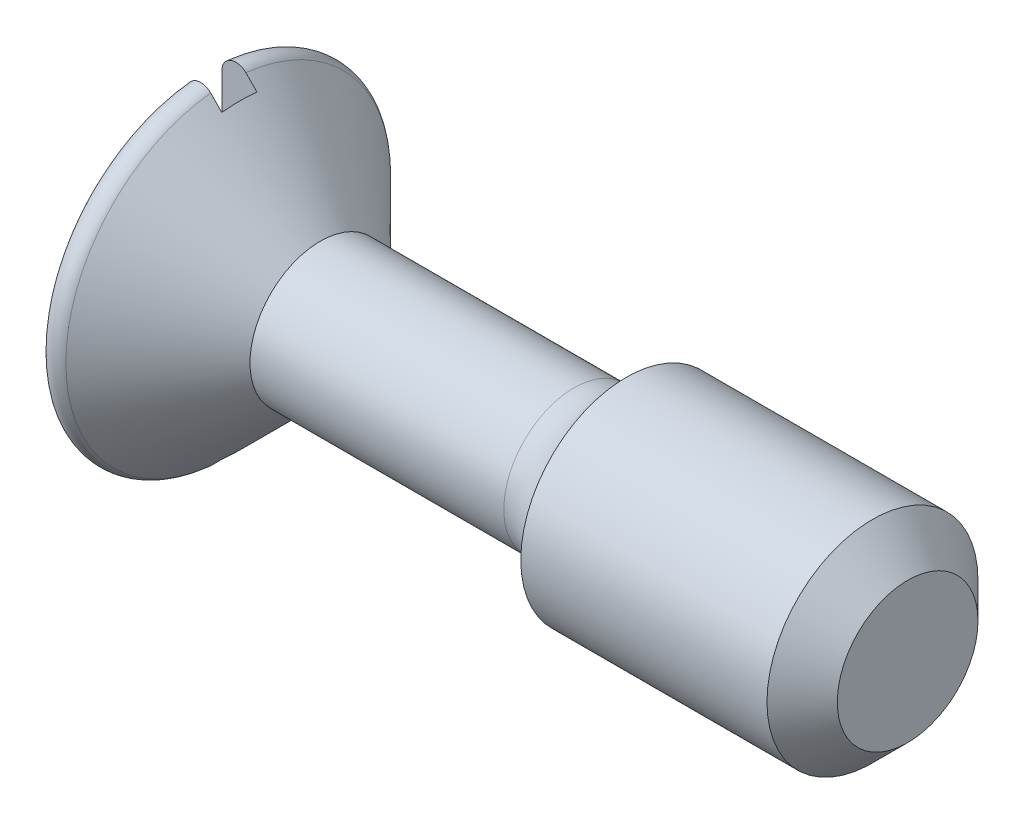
ISO-10303-21;
HEADER;
FILE_DESCRIPTION(('STEP AP214'),'2;1');
FILE_NAME('part.step','',(''),(''),'','','');
FILE_SCHEMA(('AUTOMOTIVE_DESIGN { 1 0 10303 214 1 1 1 1 }'));
ENDSEC;
DATA;
#1=APPLICATION_CONTEXT('core data for automotive mechanical design processes');
#2=APPLICATION_PROTOCOL_DEFINITION('international standard','automotive_design',2000,#1);
#3=PRODUCT_CONTEXT('',#1,'mechanical');
#4=PRODUCT('Part','Part','',(#3));
#5=PRODUCT_RELATED_PRODUCT_CATEGORY('part','',(#4));
#6=PRODUCT_DEFINITION_FORMATION('','',#4);
#7=PRODUCT_DEFINITION_CONTEXT('part definition',#1,'design');
#8=PRODUCT_DEFINITION('design','',#6,#7);
#9=PRODUCT_DEFINITION_SHAPE('','',#8);
#10=(LENGTH_UNIT() NAMED_UNIT(*) SI_UNIT(.MILLI.,.METRE.));
#11=(NAMED_UNIT(*) PLANE_ANGLE_UNIT() SI_UNIT($,.RADIAN.));
#12=(NAMED_UNIT(*) SI_UNIT($,.STERADIAN.) SOLID_ANGLE_UNIT());
#13=UNCERTAINTY_MEASURE_WITH_UNIT(LENGTH_MEASURE(1.E-05),#10,'distance_accuracy_value','');
#14=(GEOMETRIC_REPRESENTATION_CONTEXT(3) GLOBAL_UNCERTAINTY_ASSIGNED_CONTEXT((#13)) GLOBAL_UNIT_ASSIGNED_CONTEXT((#10,
#11,#12)) REPRESENTATION_CONTEXT('',''));
#15=CARTESIAN_POINT('',(0.,0.,0.));
#16=DIRECTION('',(0.,0.,1.));
#17=DIRECTION('',(1.,0.,0.));
#18=AXIS2_PLACEMENT_3D('',#15,#16,#17);
#19=CARTESIAN_POINT('',(10.,0.,0.));
#20=DIRECTION('',(-1.,0.,0.));
#21=DIRECTION('',(0.,0.,1.));
#22=AXIS2_PLACEMENT_3D('',#19,#20,#21);
#23=CYLINDRICAL_SURFACE('',#22,1.);
#24=CARTESIAN_POINT('',(5.25838015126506,0.,0.));
#25=DIRECTION('',(1.,0.,0.));
#26=DIRECTION('',(0.,0.,-1.));
#27=AXIS2_PLACEMENT_3D('',#24,#25,#26);
#28=CIRCLE('',#27,1.);
#29=CARTESIAN_POINT('',(5.25838015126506,0.,-1.));
#30=VERTEX_POINT('',#29);
#31=EDGE_CURVE('E127',#30,#30,#28,.F.);
#32=ORIENTED_EDGE('',*,*,#31,.T.);
#33=EDGE_LOOP('',(#32));
#34=FACE_BOUND('',#33,.T.);
#35=CARTESIAN_POINT('',(1.65,0.,0.));
#36=DIRECTION('',(1.,0.,0.));
#37=DIRECTION('',(0.,0.,-1.));
#38=AXIS2_PLACEMENT_3D('',#35,#36,#37);
#39=CIRCLE('',#38,1.);
#40=CARTESIAN_POINT('',(1.65,0.,-1.));
#41=VERTEX_POINT('',#40);
#42=EDGE_CURVE('E175',#41,#41,#39,.T.);
#43=ORIENTED_EDGE('',*,*,#42,.T.);
#44=EDGE_LOOP('',(#43));
#45=FACE_BOUND('',#44,.T.);
#46=ADVANCED_FACE('F37',(#34,#45),#23,.T.);
#47=CARTESIAN_POINT('',(0.,0.,0.));
#48=DIRECTION('',(1.,0.,0.));
#49=DIRECTION('',(0.,0.,-1.));
#50=AXIS2_PLACEMENT_3D('',#47,#48,#49);
#51=PLANE('',#50);
#52=DIRECTION('',(0.,-1.,0.));
#53=VECTOR('',#52,1.);
#54=CARTESIAN_POINT('',(0.,0.,0.25));
#55=LINE('',#54,#53);
#56=CARTESIAN_POINT('',(0.,2.15268918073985,0.25));
#57=VERTEX_POINT('',#56);
#58=CARTESIAN_POINT('',(0.,-2.15268918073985,0.25));
#59=VERTEX_POINT('',#58);
#60=EDGE_CURVE('E121',#57,#59,#55,.T.);
#61=ORIENTED_EDGE('',*,*,#60,.T.);
#62=CARTESIAN_POINT('',(0.,0.,0.));
#63=DIRECTION('',(1.,0.,0.));
#64=DIRECTION('',(0.,0.,-1.));
#65=AXIS2_PLACEMENT_3D('',#62,#63,#64);
#66=CIRCLE('',#65,2.16715728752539);
#67=EDGE_CURVE('E212',#59,#57,#66,.F.);
#68=ORIENTED_EDGE('',*,*,#67,.T.);
#69=EDGE_LOOP('',(#61,#68));
#70=FACE_BOUND('',#69,.T.);
#71=ADVANCED_FACE('F180',(#70),#51,.F.);
#72=CARTESIAN_POINT('',(1.65,0.,0.));
#73=DIRECTION('',(-1.,0.,0.));
#74=DIRECTION('',(0.,0.,-1.));
#75=AXIS2_PLACEMENT_3D('',#72,#73,#74);
#76=CONICAL_SURFACE('',#75,1.,0.78539816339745);
#77=CARTESIAN_POINT('',(-3.19431959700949,5.83897007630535,0.250000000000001));
#78=CARTESIAN_POINT('',(-2.9925484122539,5.63701255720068,0.250000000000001));
#79=CARTESIAN_POINT('',(-2.79078541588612,5.43504685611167,0.250000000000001));
#80=CARTESIAN_POINT('',(-2.38728568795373,5.03108777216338,0.250000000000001));
#81=CARTESIAN_POINT('',(-2.18554895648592,4.82909438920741,0.250000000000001));
#82=CARTESIAN_POINT('',(-1.78209774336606,4.42505469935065,0.250000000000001));
#83=CARTESIAN_POINT('',(-1.5803832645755,4.22300838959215,0.250000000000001));
#84=CARTESIAN_POINT('',(-1.17701269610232,3.81885891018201,0.25));
#85=CARTESIAN_POINT('',(-0.975356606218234,3.61675574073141,0.25));
#86=CARTESIAN_POINT('',(-0.572415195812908,3.21273755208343,0.25));
#87=CARTESIAN_POINT('',(-0.371129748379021,3.01082265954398,0.25));
#88=CARTESIAN_POINT('',(0.0312756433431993,2.60682402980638,0.25));
#89=CARTESIAN_POINT('',(0.232395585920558,2.40474029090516,0.25));
#90=CARTESIAN_POINT('',(0.634311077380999,2.00026706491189,0.25));
#91=CARTESIAN_POINT('',(0.835106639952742,1.79787759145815,0.25));
#92=CARTESIAN_POINT('',(1.13564700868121,1.49365156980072,0.25));
#93=CARTESIAN_POINT('',(1.2357174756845,1.39213677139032,0.249999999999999));
#94=CARTESIAN_POINT('',(1.43545086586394,1.18870725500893,0.249999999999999));
#95=CARTESIAN_POINT('',(1.5351137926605,1.08679254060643,0.249999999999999));
#96=CARTESIAN_POINT('',(1.6614682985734,0.956420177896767,0.249999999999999));
#97=CARTESIAN_POINT('',(1.68858376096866,0.928373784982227,0.249999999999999));
#98=CARTESIAN_POINT('',(1.74271923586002,0.872189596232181,0.249999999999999));
#99=CARTESIAN_POINT('',(1.7697392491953,0.844051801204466,0.249999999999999));
#100=CARTESIAN_POINT('',(1.85064043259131,0.759444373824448,0.249999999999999));
#101=CARTESIAN_POINT('',(1.90434197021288,0.702802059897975,0.249999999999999));
#102=CARTESIAN_POINT('',(1.99321764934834,0.607497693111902,0.249999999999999));
#103=CARTESIAN_POINT('',(2.02865077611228,0.569078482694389,0.249999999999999));
#104=CARTESIAN_POINT('',(2.08122108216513,0.510956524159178,0.249999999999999));
#105=CARTESIAN_POINT('',(2.09864022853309,0.491509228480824,0.249999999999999));
#106=CARTESIAN_POINT('',(2.13322258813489,0.452374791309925,0.249999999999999));
#107=CARTESIAN_POINT('',(2.15038570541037,0.432687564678,0.249999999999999));
#108=CARTESIAN_POINT('',(2.19098847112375,0.385224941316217,0.249999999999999));
#109=CARTESIAN_POINT('',(2.21425447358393,0.357300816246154,0.249999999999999));
#110=CARTESIAN_POINT('',(2.25952453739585,0.300453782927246,0.249999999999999));
#111=CARTESIAN_POINT('',(2.28152963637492,0.271531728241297,0.249999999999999));
#112=CARTESIAN_POINT('',(2.31841483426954,0.218468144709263,0.249999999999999));
#113=CARTESIAN_POINT('',(2.33379613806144,0.194678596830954,0.249999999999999));
#114=CARTESIAN_POINT('',(2.36152808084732,0.145369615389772,0.249999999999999));
#115=CARTESIAN_POINT('',(2.37389137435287,0.119857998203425,0.249999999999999));
#116=CARTESIAN_POINT('',(2.38836926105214,0.0783628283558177,0.249999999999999));
#117=CARTESIAN_POINT('',(2.3925984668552,0.0631513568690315,0.249999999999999));
#118=CARTESIAN_POINT('',(2.39838048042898,0.0322553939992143,0.249999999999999));
#119=CARTESIAN_POINT('',(2.39994347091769,0.0165729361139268,0.249999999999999));
#120=CARTESIAN_POINT('',(2.40005362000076,-0.014866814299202,0.249999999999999));
#121=CARTESIAN_POINT('',(2.39858853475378,-0.0306241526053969,0.249999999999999));
#122=CARTESIAN_POINT('',(2.39296444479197,-0.0616709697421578,0.249999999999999));
#123=CARTESIAN_POINT('',(2.38879654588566,-0.0769587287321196,0.249999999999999));
#124=CARTESIAN_POINT('',(2.37808786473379,-0.108010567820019,0.249999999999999));
#125=CARTESIAN_POINT('',(2.37138508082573,-0.123716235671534,0.249999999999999));
#126=CARTESIAN_POINT('',(2.35646848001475,-0.154405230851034,0.249999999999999));
#127=CARTESIAN_POINT('',(2.34825171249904,-0.169387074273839,0.249999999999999));
#128=CARTESIAN_POINT('',(2.33076684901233,-0.198876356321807,0.249999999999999));
#129=CARTESIAN_POINT('',(2.32149084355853,-0.213379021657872,0.249999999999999));
#130=CARTESIAN_POINT('',(2.30227623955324,-0.241913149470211,0.249999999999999));
#131=CARTESIAN_POINT('',(2.29233826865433,-0.255945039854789,0.249999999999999));
#132=CARTESIAN_POINT('',(2.25986484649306,-0.300232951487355,0.249999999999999));
#133=CARTESIAN_POINT('',(2.23646143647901,-0.329847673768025,0.249999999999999));
#134=CARTESIAN_POINT('',(2.18856631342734,-0.388188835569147,0.249999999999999));
#135=CARTESIAN_POINT('',(2.16407394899,-0.4169147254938,0.249999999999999));
#136=CARTESIAN_POINT('',(2.11441429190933,-0.473863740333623,0.249999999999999));
#137=CARTESIAN_POINT('',(2.08924591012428,-0.502085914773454,0.249999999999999));
#138=CARTESIAN_POINT('',(2.03852163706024,-0.558163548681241,0.249999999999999));
#139=CARTESIAN_POINT('',(2.01296585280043,-0.586019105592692,0.249999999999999));
#140=CARTESIAN_POINT('',(1.93609490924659,-0.669031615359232,0.249999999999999));
#141=CARTESIAN_POINT('',(1.88439780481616,-0.723834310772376,0.249999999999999));
#142=CARTESIAN_POINT('',(1.7805451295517,-0.832896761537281,0.249999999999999));
#143=CARTESIAN_POINT('',(1.72839006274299,-0.887157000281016,0.249999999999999));
#144=CARTESIAN_POINT('',(1.57190285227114,-1.04908694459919,0.249999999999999));
#145=CARTESIAN_POINT('',(1.46713894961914,-1.15633908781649,0.249999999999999));
#146=CARTESIAN_POINT('',(1.25714145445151,-1.37038437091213,0.249999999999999));
#147=CARTESIAN_POINT('',(1.15190785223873,-1.47717750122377,0.25));
#148=CARTESIAN_POINT('',(0.941142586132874,-1.69055441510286,0.25));
#149=CARTESIAN_POINT('',(0.8356108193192,-1.7971380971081,0.25));
#150=CARTESIAN_POINT('',(0.624401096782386,-2.01015864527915,0.25));
#151=CARTESIAN_POINT('',(0.518723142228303,-2.1165955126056,0.25));
#152=CARTESIAN_POINT('',(0.20147681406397,-2.43584587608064,0.25));
#153=CARTESIAN_POINT('',(-0.0102287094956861,-2.64852308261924,0.25));
#154=CARTESIAN_POINT('',(-0.433782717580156,-3.07368516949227,0.25));
#155=CARTESIAN_POINT('',(-0.645631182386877,-3.28617006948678,0.25));
#156=CARTESIAN_POINT('',(-1.05220298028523,-3.69377867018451,0.25));
#157=CARTESIAN_POINT('',(-1.24691881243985,-3.8889098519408,0.250000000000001));
#158=CARTESIAN_POINT('',(-1.63640898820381,-4.27912870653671,0.250000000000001));
#159=CARTESIAN_POINT('',(-1.83118333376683,-4.47421637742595,0.250000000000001));
#160=CARTESIAN_POINT('',(-2.220674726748,-4.86426578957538,0.250000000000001));
#161=CARTESIAN_POINT('',(-2.41539175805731,-5.05922754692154,0.250000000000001));
#162=CARTESIAN_POINT('',(-2.80484316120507,-5.44911879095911,0.250000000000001));
#163=CARTESIAN_POINT('',(-2.99957753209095,-5.64404827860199,0.250000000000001));
#164=CARTESIAN_POINT('',(-3.19431959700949,-5.83897007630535,0.250000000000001));
#165=B_SPLINE_CURVE_WITH_KNOTS('',3,(#77,#78,#79,#80,#81,#82,#83,#84,#85,#86,#87,#88,#89,#90,
#91,#92,#93,#94,#95,#96,#97,#98,#99,#100,#101,#102,#103,#104,#105,#106,#107,#108,#109,#110,#111,
#112,#113,#114,#115,#116,#117,#118,#119,#120,#121,#122,#123,#124,#125,#126,#127,#128,#129,#130,
#131,#132,#133,#134,#135,#136,#137,#138,#139,#140,#141,#142,#143,#144,#145,#146,#147,#148,#149,
#150,#151,#152,#153,#154,#155,#156,#157,#158,#159,#160,#161,#162,#163,#164),.UNSPECIFIED.,.F.,
.F.,(4,2,2,2,2,2,2,2,2,2,2,2,2,2,2,2,2,2,2,2,2,2,2,2,2,2,2,2,2,2,2,2,2,2,2,2,2,2,2,2,2,2,2,4),
(0.,0.856438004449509,1.71287908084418,2.56938533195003,3.42588859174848,4.28120659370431,
5.13653332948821,5.99182297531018,6.41946070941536,6.84709463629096,6.96412703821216,
7.08115840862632,7.31531054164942,7.47209628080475,7.5504185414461,7.62876945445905,
7.73779779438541,7.84673508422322,7.93165321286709,8.0162089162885,8.06339467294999,
8.11039981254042,8.15759538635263,8.2049470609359,8.25605487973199,8.30726337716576,
8.35888291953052,8.41045419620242,8.5236270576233,8.63686855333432,8.75030496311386,
8.86371058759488,9.08971828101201,9.3155024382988,9.7652819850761,10.2150708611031,
10.6650407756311,11.115007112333,12.0152608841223,12.9154088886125,13.7423997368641,
14.5694222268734,15.3960559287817,16.2226578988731),.UNSPECIFIED.);
#166=CARTESIAN_POINT('',(0.34142135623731,2.29500225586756,0.25));
#167=VERTEX_POINT('',#166);
#168=CARTESIAN_POINT('',(0.5,2.13541565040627,0.25));
#169=VERTEX_POINT('',#168);
#170=EDGE_CURVE('E169',#167,#169,#165,.T.);
#171=ORIENTED_EDGE('',*,*,#170,.F.);
#172=CARTESIAN_POINT('',(0.34142135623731,0.,0.));
#173=DIRECTION('',(-1.,0.,0.));
#174=DIRECTION('',(0.,0.,1.));
#175=AXIS2_PLACEMENT_3D('',#172,#173,#174);
#176=CIRCLE('',#175,2.30857864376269);
#177=CARTESIAN_POINT('',(0.341421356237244,-2.29500225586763,0.25));
#178=VERTEX_POINT('',#177);
#179=EDGE_CURVE('E132',#167,#178,#176,.F.);
#180=ORIENTED_EDGE('',*,*,#179,.T.);
#181=CARTESIAN_POINT('',(0.5,-2.13541565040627,0.25));
#182=VERTEX_POINT('',#181);
#183=EDGE_CURVE('E98',#182,#178,#165,.T.);
#184=ORIENTED_EDGE('',*,*,#183,.F.);
#185=CARTESIAN_POINT('',(0.5,0.,0.));
#186=DIRECTION('',(1.,0.,0.));
#187=DIRECTION('',(0.,0.,-1.));
#188=AXIS2_PLACEMENT_3D('',#185,#186,#187);
#189=CIRCLE('',#188,2.15);
#190=CARTESIAN_POINT('',(0.5,-2.13541565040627,-0.25));
#191=VERTEX_POINT('',#190);
#192=EDGE_CURVE('E104',#191,#182,#189,.F.);
#193=ORIENTED_EDGE('',*,*,#192,.F.);
#194=CARTESIAN_POINT('',(-3.19431959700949,-5.83897007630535,-0.25));
#195=CARTESIAN_POINT('',(-2.9925484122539,-5.63701255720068,-0.25));
#196=CARTESIAN_POINT('',(-2.79078541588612,-5.43504685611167,-0.25));
#197=CARTESIAN_POINT('',(-2.38728568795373,-5.03108777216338,-0.25));
#198=CARTESIAN_POINT('',(-2.18554895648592,-4.82909438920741,-0.25));
#199=CARTESIAN_POINT('',(-1.78209774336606,-4.42505469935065,-0.25));
#200=CARTESIAN_POINT('',(-1.5803832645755,-4.22300838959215,-0.25));
#201=CARTESIAN_POINT('',(-1.17701269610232,-3.81885891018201,-0.25));
#202=CARTESIAN_POINT('',(-0.975356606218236,-3.61675574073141,-0.25));
#203=CARTESIAN_POINT('',(-0.572415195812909,-3.21273755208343,-0.25));
#204=CARTESIAN_POINT('',(-0.371129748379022,-3.01082265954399,-0.25));
#205=CARTESIAN_POINT('',(0.0312756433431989,-2.60682402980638,-0.25));
#206=CARTESIAN_POINT('',(0.232395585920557,-2.40474029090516,-0.25));
#207=CARTESIAN_POINT('',(0.634311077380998,-2.00026706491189,-0.25));
#208=CARTESIAN_POINT('',(0.835106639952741,-1.79787759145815,-0.25));
#209=CARTESIAN_POINT('',(1.13564700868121,-1.49365156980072,-0.25));
#210=CARTESIAN_POINT('',(1.2357174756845,-1.39213677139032,-0.25));
#211=CARTESIAN_POINT('',(1.43545086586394,-1.18870725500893,-0.25));
#212=CARTESIAN_POINT('',(1.5351137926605,-1.08679254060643,-0.25));
#213=CARTESIAN_POINT('',(1.6614682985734,-0.956420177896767,-0.25));
#214=CARTESIAN_POINT('',(1.68858376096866,-0.928373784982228,-0.25));
#215=CARTESIAN_POINT('',(1.74271923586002,-0.872189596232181,-0.25));
#216=CARTESIAN_POINT('',(1.7697392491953,-0.844051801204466,-0.25));
#217=CARTESIAN_POINT('',(1.85064043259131,-0.759444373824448,-0.25));
#218=CARTESIAN_POINT('',(1.90434197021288,-0.702802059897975,-0.25));
#219=CARTESIAN_POINT('',(1.99321764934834,-0.607497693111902,-0.25));
#220=CARTESIAN_POINT('',(2.02865077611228,-0.569078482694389,-0.25));
#221=CARTESIAN_POINT('',(2.08122108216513,-0.510956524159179,-0.25));
#222=CARTESIAN_POINT('',(2.09864022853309,-0.491509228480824,-0.25));
#223=CARTESIAN_POINT('',(2.13322258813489,-0.452374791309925,-0.25));
#224=CARTESIAN_POINT('',(2.15038570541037,-0.432687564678,-0.25));
#225=CARTESIAN_POINT('',(2.19098847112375,-0.385224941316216,-0.25));
#226=CARTESIAN_POINT('',(2.21425447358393,-0.357300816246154,-0.25));
#227=CARTESIAN_POINT('',(2.25952453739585,-0.300453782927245,-0.25));
#228=CARTESIAN_POINT('',(2.28152963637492,-0.271531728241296,-0.25));
#229=CARTESIAN_POINT('',(2.31841483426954,-0.218468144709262,-0.25));
#230=CARTESIAN_POINT('',(2.33379613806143,-0.194678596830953,-0.25));
#231=CARTESIAN_POINT('',(2.36152808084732,-0.145369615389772,-0.25));
#232=CARTESIAN_POINT('',(2.37389137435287,-0.119857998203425,-0.25));
#233=CARTESIAN_POINT('',(2.38836926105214,-0.078362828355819,-0.25));
#234=CARTESIAN_POINT('',(2.3925984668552,-0.0631513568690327,-0.25));
#235=CARTESIAN_POINT('',(2.39838048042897,-0.0322553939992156,-0.25));
#236=CARTESIAN_POINT('',(2.39994347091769,-0.0165729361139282,-0.25));
#237=CARTESIAN_POINT('',(2.40005362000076,0.0148668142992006,-0.25));
#238=CARTESIAN_POINT('',(2.39858853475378,0.0306241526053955,-0.25));
#239=CARTESIAN_POINT('',(2.39296444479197,0.0616709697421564,-0.25));
#240=CARTESIAN_POINT('',(2.38879654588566,0.0769587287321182,-0.25));
#241=CARTESIAN_POINT('',(2.37808786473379,0.108010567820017,-0.25));
#242=CARTESIAN_POINT('',(2.37138508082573,0.123716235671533,-0.25));
#243=CARTESIAN_POINT('',(2.35646848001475,0.154405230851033,-0.25));
#244=CARTESIAN_POINT('',(2.34825171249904,0.169387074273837,-0.25));
#245=CARTESIAN_POINT('',(2.33076684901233,0.198876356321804,-0.25));
#246=CARTESIAN_POINT('',(2.32149084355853,0.213379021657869,-0.25));
#247=CARTESIAN_POINT('',(2.30227623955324,0.241913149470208,-0.25));
#248=CARTESIAN_POINT('',(2.29233826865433,0.255945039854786,-0.25));
#249=CARTESIAN_POINT('',(2.25986484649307,0.300232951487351,-0.25));
#250=CARTESIAN_POINT('',(2.23646143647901,0.32984767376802,-0.25));
#251=CARTESIAN_POINT('',(2.18856631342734,0.388188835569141,-0.25));
#252=CARTESIAN_POINT('',(2.16407394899,0.416914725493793,-0.25));
#253=CARTESIAN_POINT('',(2.11441429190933,0.473863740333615,-0.25));
#254=CARTESIAN_POINT('',(2.08924591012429,0.502085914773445,-0.25));
#255=CARTESIAN_POINT('',(2.03852163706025,0.558163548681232,-0.25));
#256=CARTESIAN_POINT('',(2.01296585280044,0.586019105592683,-0.25));
#257=CARTESIAN_POINT('',(1.9360949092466,0.669031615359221,-0.25));
#258=CARTESIAN_POINT('',(1.88439780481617,0.723834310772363,-0.25));
#259=CARTESIAN_POINT('',(1.78054512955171,0.832896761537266,-0.25));
#260=CARTESIAN_POINT('',(1.728390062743,0.887157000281,-0.25));
#261=CARTESIAN_POINT('',(1.57190285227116,1.04908694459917,-0.25));
#262=CARTESIAN_POINT('',(1.46713894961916,1.15633908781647,-0.25));
#263=CARTESIAN_POINT('',(1.25714145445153,1.37038437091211,-0.25));
#264=CARTESIAN_POINT('',(1.15190785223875,1.47717750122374,-0.25));
#265=CARTESIAN_POINT('',(0.941142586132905,1.69055441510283,-0.25));
#266=CARTESIAN_POINT('',(0.835610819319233,1.79713809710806,-0.25));
#267=CARTESIAN_POINT('',(0.624401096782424,2.01015864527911,-0.25));
#268=CARTESIAN_POINT('',(0.518723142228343,2.11659551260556,-0.25));
#269=CARTESIAN_POINT('',(0.201476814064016,2.43584587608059,-0.25));
#270=CARTESIAN_POINT('',(-0.0102287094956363,2.64852308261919,-0.25));
#271=CARTESIAN_POINT('',(-0.433782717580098,3.07368516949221,-0.25));
#272=CARTESIAN_POINT('',(-0.645631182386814,3.28617006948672,-0.25));
#273=CARTESIAN_POINT('',(-1.05220298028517,3.69377867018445,-0.25));
#274=CARTESIAN_POINT('',(-1.24691881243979,3.88890985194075,-0.25));
#275=CARTESIAN_POINT('',(-1.63640898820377,4.27912870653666,-0.25));
#276=CARTESIAN_POINT('',(-1.83118333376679,4.47421637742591,-0.25));
#277=CARTESIAN_POINT('',(-2.22067472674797,4.86426578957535,-0.25));
#278=CARTESIAN_POINT('',(-2.41539175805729,5.05922754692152,-0.25));
#279=CARTESIAN_POINT('',(-2.80484316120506,5.4491187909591,-0.25));
#280=CARTESIAN_POINT('',(-2.99957753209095,5.64404827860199,-0.25));
#281=CARTESIAN_POINT('',(-3.19431959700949,5.83897007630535,-0.25));
#282=B_SPLINE_CURVE_WITH_KNOTS('',3,(#194,#195,#196,#197,#198,#199,#200,#201,#202,#203,#204,
#205,#206,#207,#208,#209,#210,#211,#212,#213,#214,#215,#216,#217,#218,#219,#220,#221,#222,#223,
#224,#225,#226,#227,#228,#229,#230,#231,#232,#233,#234,#235,#236,#237,#238,#239,#240,#241,#242,
#243,#244,#245,#246,#247,#248,#249,#250,#251,#252,#253,#254,#255,#256,#257,#258,#259,#260,#261,
#262,#263,#264,#265,#266,#267,#268,#269,#270,#271,#272,#273,#274,#275,#276,#277,#278,#279,#280,
#281),.UNSPECIFIED.,.F.,.F.,(4,2,2,2,2,2,2,2,2,2,2,2,2,2,2,2,2,2,2,2,2,2,2,2,2,2,2,2,2,2,2,2,2,
2,2,2,2,2,2,2,2,2,2,4),(0.,0.856438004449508,1.71287908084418,2.56938533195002,3.42588859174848,
4.28120659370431,5.1365333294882,5.99182297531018,6.41946070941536,6.84709463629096,
6.96412703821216,7.08115840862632,7.31531054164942,7.47209628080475,7.5504185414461,
7.62876945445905,7.73779779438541,7.84673508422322,7.93165321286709,8.01620891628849,
8.06339467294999,8.11039981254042,8.15759538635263,8.20494706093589,8.25605487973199,
8.30726337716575,8.35888291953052,8.41045419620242,8.5236270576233,8.63686855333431,
8.75030496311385,8.86371058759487,9.08971828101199,9.31550243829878,9.76528198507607,
10.215070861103,10.6650407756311,11.115007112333,12.0152608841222,12.9154088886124,
13.742399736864,14.5694222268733,15.3960559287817,16.2226578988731),.UNSPECIFIED.);
#283=CARTESIAN_POINT('',(0.341421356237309,-2.29500225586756,-0.25));
#284=VERTEX_POINT('',#283);
#285=EDGE_CURVE('E87',#284,#191,#282,.T.);
#286=ORIENTED_EDGE('',*,*,#285,.F.);
#287=CARTESIAN_POINT('',(0.34142135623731,0.,0.));
#288=DIRECTION('',(-1.,0.,0.));
#289=DIRECTION('',(0.,0.,1.));
#290=AXIS2_PLACEMENT_3D('',#287,#288,#289);
#291=CIRCLE('',#290,2.30857864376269);
#292=CARTESIAN_POINT('',(0.341421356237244,2.29500225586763,-0.25));
#293=VERTEX_POINT('',#292);
#294=EDGE_CURVE('E130',#284,#293,#291,.F.);
#295=ORIENTED_EDGE('',*,*,#294,.T.);
#296=CARTESIAN_POINT('',(0.5,2.13541565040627,-0.25));
#297=VERTEX_POINT('',#296);
#298=EDGE_CURVE('E99',#297,#293,#282,.T.);
#299=ORIENTED_EDGE('',*,*,#298,.F.);
#300=EDGE_CURVE('E107',#169,#297,#189,.F.);
#301=ORIENTED_EDGE('',*,*,#300,.F.);
#302=EDGE_LOOP('',(#171,#180,#184,#193,#286,#295,#299,#301));
#303=FACE_BOUND('',#302,.T.);
#304=ORIENTED_EDGE('',*,*,#42,.F.);
#305=EDGE_LOOP('',(#304));
#306=FACE_BOUND('',#305,.T.);
#307=ADVANCED_FACE('F112',(#303,#306),#76,.T.);
#308=DIRECTION('',(0.,1.,0.));
#309=VECTOR('',#308,1.);
#310=CARTESIAN_POINT('',(0.,0.,-0.25));
#311=LINE('',#310,#309);
#312=CARTESIAN_POINT('',(0.,-2.15268918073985,-0.25));
#313=VERTEX_POINT('',#312);
#314=CARTESIAN_POINT('',(0.,2.15268918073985,-0.25));
#315=VERTEX_POINT('',#314);
#316=EDGE_CURVE('E204',#313,#315,#311,.T.);
#317=ORIENTED_EDGE('',*,*,#316,.T.);
#318=CARTESIAN_POINT('',(0.,0.,0.));
#319=DIRECTION('',(1.,0.,0.));
#320=DIRECTION('',(0.,0.,-1.));
#321=AXIS2_PLACEMENT_3D('',#318,#319,#320);
#322=CIRCLE('',#321,2.16715728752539);
#323=EDGE_CURVE('E11',#315,#313,#322,.F.);
#324=ORIENTED_EDGE('',*,*,#323,.T.);
#325=EDGE_LOOP('',(#317,#324));
#326=FACE_BOUND('',#325,.T.);
#327=ADVANCED_FACE('F155',(#326),#51,.F.);
#328=CARTESIAN_POINT('',(0.,-2.65000000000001,0.25));
#329=DIRECTION('',(0.,0.,1.));
#330=DIRECTION('',(1.,0.,0.));
#331=AXIS2_PLACEMENT_3D('',#328,#329,#330);
#332=PLANE('',#331);
#333=ORIENTED_EDGE('',*,*,#183,.T.);
#334=CARTESIAN_POINT('',(0.34142135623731,-2.29500225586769,0.249999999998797));
#335=CARTESIAN_POINT('',(0.333507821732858,-2.30297639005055,0.249999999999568));
#336=CARTESIAN_POINT('',(0.324912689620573,-2.31027022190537,0.249999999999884));
#337=CARTESIAN_POINT('',(0.306630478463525,-2.32331685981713,0.250000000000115));
#338=CARTESIAN_POINT('',(0.296944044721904,-2.32907056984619,0.250000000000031));
#339=CARTESIAN_POINT('',(0.276734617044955,-2.33886921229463,0.249999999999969));
#340=CARTESIAN_POINT('',(0.266211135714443,-2.3429131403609,0.249999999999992));
#341=CARTESIAN_POINT('',(0.244636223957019,-2.34917033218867,0.250000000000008));
#342=CARTESIAN_POINT('',(0.233584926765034,-2.35138405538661,0.250000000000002));
#343=CARTESIAN_POINT('',(0.211300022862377,-2.35391298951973,0.249999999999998));
#344=CARTESIAN_POINT('',(0.200067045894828,-2.35423374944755,0.249999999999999));
#345=CARTESIAN_POINT('',(0.177705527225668,-2.35298228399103,0.25));
#346=CARTESIAN_POINT('',(0.166576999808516,-2.35140980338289,0.25));
#347=CARTESIAN_POINT('',(0.144757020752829,-2.34642083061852,0.25));
#348=CARTESIAN_POINT('',(0.134065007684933,-2.34300679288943,0.25));
#349=CARTESIAN_POINT('',(0.113404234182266,-2.33443579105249,0.25));
#350=CARTESIAN_POINT('',(0.103435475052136,-2.32927882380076,0.25));
#351=CARTESIAN_POINT('',(0.0844799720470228,-2.31735819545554,0.25));
#352=CARTESIAN_POINT('',(0.0754953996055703,-2.31059108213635,0.25));
#353=CARTESIAN_POINT('',(0.0587843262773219,-2.29565206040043,0.25));
#354=CARTESIAN_POINT('',(0.0510576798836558,-2.28748031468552,0.25));
#355=CARTESIAN_POINT('',(0.0370406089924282,-2.26992267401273,0.25));
#356=CARTESIAN_POINT('',(0.0307571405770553,-2.26053122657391,0.25));
#357=CARTESIAN_POINT('',(0.0198432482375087,-2.2408294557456,0.25));
#358=CARTESIAN_POINT('',(0.0152132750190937,-2.23051888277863,0.25));
#359=CARTESIAN_POINT('',(0.00768639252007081,-2.2091282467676,0.25));
#360=CARTESIAN_POINT('',(0.00481349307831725,-2.1980397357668,0.25));
#361=CARTESIAN_POINT('',(0.000964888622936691,-2.17553135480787,0.25));
#362=CARTESIAN_POINT('',(-9.61835724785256E-06,-2.16411128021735,0.25));
#363=CARTESIAN_POINT('',(0.,-2.15268918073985,0.25));
#364=B_SPLINE_CURVE_WITH_KNOTS('',3,(#334,#335,#336,#337,#338,#339,#340,#341,#342,#343,#344,
#345,#346,#347,#348,#349,#350,#351,#352,#353,#354,#355,#356,#357,#358,#359,#360,#361,#362,#363),
.UNSPECIFIED.,.F.,.F.,(4,2,2,2,2,2,2,2,2,2,2,2,2,2,4),(0.,0.0336599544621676,0.0673001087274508,
0.100959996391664,0.134611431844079,0.168164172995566,0.201721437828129,0.235234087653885,
0.268746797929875,0.30233201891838,0.335913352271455,0.369653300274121,0.403402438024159,
0.437603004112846,0.471825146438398),.UNSPECIFIED.);
#365=EDGE_CURVE('E141',#178,#59,#364,.T.);
#366=ORIENTED_EDGE('',*,*,#365,.T.);
#367=ORIENTED_EDGE('',*,*,#60,.F.);
#368=CARTESIAN_POINT('',(0.,2.15268918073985,0.25));
#369=CARTESIAN_POINT('',(-9.36040584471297E-06,2.1640630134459,0.25));
#370=CARTESIAN_POINT('',(0.000956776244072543,2.17543460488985,0.25));
#371=CARTESIAN_POINT('',(0.00477301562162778,2.19785127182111,0.25));
#372=CARTESIAN_POINT('',(0.00762211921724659,2.20889651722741,0.25));
#373=CARTESIAN_POINT('',(0.015139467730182,2.2303571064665,0.25));
#374=CARTESIAN_POINT('',(0.019808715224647,2.24077209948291,0.25));
#375=CARTESIAN_POINT('',(0.0308336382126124,2.26066432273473,0.25));
#376=CARTESIAN_POINT('',(0.0371888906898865,2.27014178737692,0.25));
#377=CARTESIAN_POINT('',(0.0513857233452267,2.28785683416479,0.25));
#378=CARTESIAN_POINT('',(0.0592222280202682,2.29609848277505,0.25));
#379=CARTESIAN_POINT('',(0.0761759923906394,2.31114079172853,0.25));
#380=CARTESIAN_POINT('',(0.0852933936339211,2.3179412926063,0.25));
#381=CARTESIAN_POINT('',(0.104491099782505,2.32986410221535,0.25));
#382=CARTESIAN_POINT('',(0.114565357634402,2.33499614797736,0.25));
#383=CARTESIAN_POINT('',(0.135435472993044,2.34348648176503,0.25));
#384=CARTESIAN_POINT('',(0.146231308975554,2.34684482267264,0.25));
#385=CARTESIAN_POINT('',(0.168181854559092,2.35167688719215,0.25));
#386=CARTESIAN_POINT('',(0.179334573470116,2.35315965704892,0.25));
#387=CARTESIAN_POINT('',(0.20172891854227,2.35422689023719,0.25));
#388=CARTESIAN_POINT('',(0.212970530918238,2.35381164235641,0.25));
#389=CARTESIAN_POINT('',(0.235197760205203,2.35109871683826,0.25));
#390=CARTESIAN_POINT('',(0.246183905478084,2.34880536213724,0.25));
#391=CARTESIAN_POINT('',(0.267618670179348,2.34240855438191,0.25));
#392=CARTESIAN_POINT('',(0.278067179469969,2.33830473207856,0.25));
#393=CARTESIAN_POINT('',(0.297956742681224,2.32848873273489,0.25));
#394=CARTESIAN_POINT('',(0.307411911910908,2.32280510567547,0.25));
#395=CARTESIAN_POINT('',(0.325269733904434,2.30996608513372,0.25));
#396=CARTESIAN_POINT('',(0.333671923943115,2.30281004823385,0.25));
#397=CARTESIAN_POINT('',(0.34142135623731,2.29500225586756,0.25));
#398=B_SPLINE_CURVE_WITH_KNOTS('',3,(#368,#369,#370,#371,#372,#373,#374,#375,#376,#377,#378,
#379,#380,#381,#382,#383,#384,#385,#386,#387,#388,#389,#390,#391,#392,#393,#394,#395,#396,#397),
.UNSPECIFIED.,.F.,.F.,(4,2,2,2,2,2,2,2,2,2,2,2,2,2,4),(0.,0.0340774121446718,0.0681367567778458,
0.102214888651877,0.136284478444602,0.17023937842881,0.204198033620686,0.237954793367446,
0.271710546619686,0.305302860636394,0.338890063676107,0.372400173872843,0.405917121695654,
0.43886386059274,0.471825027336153),.UNSPECIFIED.);
#399=EDGE_CURVE('E134',#57,#167,#398,.T.);
#400=ORIENTED_EDGE('',*,*,#399,.T.);
#401=ORIENTED_EDGE('',*,*,#170,.T.);
#402=DIRECTION('',(0.,1.,0.));
#403=VECTOR('',#402,1.);
#404=CARTESIAN_POINT('',(0.5,-2.65000000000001,0.25));
#405=LINE('',#404,#403);
#406=EDGE_CURVE('E108',#182,#169,#405,.T.);
#407=ORIENTED_EDGE('',*,*,#406,.F.);
#408=EDGE_LOOP('',(#333,#366,#367,#400,#401,#407));
#409=FACE_BOUND('',#408,.T.);
#410=ADVANCED_FACE('F150',(#409),#332,.F.);
#411=CARTESIAN_POINT('',(0.,-2.65000000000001,-0.25));
#412=DIRECTION('',(0.,0.,-1.));
#413=DIRECTION('',(-1.,0.,0.));
#414=AXIS2_PLACEMENT_3D('',#411,#412,#413);
#415=PLANE('',#414);
#416=ORIENTED_EDGE('',*,*,#298,.T.);
#417=CARTESIAN_POINT('',(0.34142135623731,2.29500225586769,-0.249999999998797));
#418=CARTESIAN_POINT('',(0.333507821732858,2.30297639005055,-0.249999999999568));
#419=CARTESIAN_POINT('',(0.324912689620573,2.31027022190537,-0.249999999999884));
#420=CARTESIAN_POINT('',(0.306630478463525,2.32331685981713,-0.250000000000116));
#421=CARTESIAN_POINT('',(0.296944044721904,2.32907056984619,-0.250000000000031));
#422=CARTESIAN_POINT('',(0.276734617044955,2.33886921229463,-0.249999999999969));
#423=CARTESIAN_POINT('',(0.266211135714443,2.3429131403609,-0.249999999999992));
#424=CARTESIAN_POINT('',(0.244636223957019,2.34917033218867,-0.250000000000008));
#425=CARTESIAN_POINT('',(0.233584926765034,2.35138405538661,-0.250000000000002));
#426=CARTESIAN_POINT('',(0.211300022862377,2.35391298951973,-0.249999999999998));
#427=CARTESIAN_POINT('',(0.200067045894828,2.35423374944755,-0.249999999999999));
#428=CARTESIAN_POINT('',(0.177705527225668,2.35298228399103,-0.250000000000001));
#429=CARTESIAN_POINT('',(0.166576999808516,2.35140980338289,-0.25));
#430=CARTESIAN_POINT('',(0.144757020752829,2.34642083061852,-0.25));
#431=CARTESIAN_POINT('',(0.134065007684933,2.34300679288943,-0.25));
#432=CARTESIAN_POINT('',(0.113404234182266,2.33443579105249,-0.25));
#433=CARTESIAN_POINT('',(0.103435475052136,2.32927882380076,-0.25));
#434=CARTESIAN_POINT('',(0.0844799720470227,2.31735819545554,-0.25));
#435=CARTESIAN_POINT('',(0.0754953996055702,2.31059108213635,-0.25));
#436=CARTESIAN_POINT('',(0.0587843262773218,2.29565206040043,-0.25));
#437=CARTESIAN_POINT('',(0.0510576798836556,2.28748031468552,-0.25));
#438=CARTESIAN_POINT('',(0.0370406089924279,2.26992267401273,-0.25));
#439=CARTESIAN_POINT('',(0.0307571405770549,2.26053122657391,-0.25));
#440=CARTESIAN_POINT('',(0.0198432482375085,2.2408294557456,-0.25));
#441=CARTESIAN_POINT('',(0.0152132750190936,2.23051888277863,-0.25));
#442=CARTESIAN_POINT('',(0.00768639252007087,2.2091282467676,-0.25));
#443=CARTESIAN_POINT('',(0.00481349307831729,2.1980397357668,-0.25));
#444=CARTESIAN_POINT('',(0.000964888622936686,2.17553135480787,-0.25));
#445=CARTESIAN_POINT('',(-9.61835724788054E-06,2.16411128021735,-0.25));
#446=CARTESIAN_POINT('',(0.,2.15268918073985,-0.25));
#447=B_SPLINE_CURVE_WITH_KNOTS('',3,(#417,#418,#419,#420,#421,#422,#423,#424,#425,#426,#427,
#428,#429,#430,#431,#432,#433,#434,#435,#436,#437,#438,#439,#440,#441,#442,#443,#444,#445,#446),
.UNSPECIFIED.,.F.,.F.,(4,2,2,2,2,2,2,2,2,2,2,2,2,2,4),(0.,0.0336599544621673,0.0673001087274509,
0.100959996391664,0.134611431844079,0.168164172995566,0.201721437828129,0.235234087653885,
0.268746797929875,0.30233201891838,0.335913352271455,0.369653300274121,0.403402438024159,
0.437603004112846,0.471825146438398),.UNSPECIFIED.);
#448=EDGE_CURVE('E46',#293,#315,#447,.T.);
#449=ORIENTED_EDGE('',*,*,#448,.T.);
#450=ORIENTED_EDGE('',*,*,#316,.F.);
#451=CARTESIAN_POINT('',(0.,-2.15268918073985,-0.25));
#452=CARTESIAN_POINT('',(-9.36040584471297E-06,-2.1640630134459,-0.25));
#453=CARTESIAN_POINT('',(0.000956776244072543,-2.17543460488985,-0.25));
#454=CARTESIAN_POINT('',(0.00477301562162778,-2.19785127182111,-0.25));
#455=CARTESIAN_POINT('',(0.00762211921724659,-2.20889651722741,-0.25));
#456=CARTESIAN_POINT('',(0.015139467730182,-2.2303571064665,-0.25));
#457=CARTESIAN_POINT('',(0.019808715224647,-2.24077209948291,-0.25));
#458=CARTESIAN_POINT('',(0.0308336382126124,-2.26066432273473,-0.25));
#459=CARTESIAN_POINT('',(0.0371888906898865,-2.27014178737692,-0.25));
#460=CARTESIAN_POINT('',(0.0513857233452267,-2.28785683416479,-0.25));
#461=CARTESIAN_POINT('',(0.0592222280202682,-2.29609848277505,-0.25));
#462=CARTESIAN_POINT('',(0.0761759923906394,-2.31114079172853,-0.25));
#463=CARTESIAN_POINT('',(0.0852933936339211,-2.3179412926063,-0.25));
#464=CARTESIAN_POINT('',(0.104491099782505,-2.32986410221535,-0.25));
#465=CARTESIAN_POINT('',(0.114565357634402,-2.33499614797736,-0.25));
#466=CARTESIAN_POINT('',(0.135435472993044,-2.34348648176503,-0.25));
#467=CARTESIAN_POINT('',(0.146231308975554,-2.34684482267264,-0.25));
#468=CARTESIAN_POINT('',(0.168181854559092,-2.35167688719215,-0.25));
#469=CARTESIAN_POINT('',(0.179334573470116,-2.35315965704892,-0.25));
#470=CARTESIAN_POINT('',(0.20172891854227,-2.35422689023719,-0.25));
#471=CARTESIAN_POINT('',(0.212970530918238,-2.35381164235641,-0.25));
#472=CARTESIAN_POINT('',(0.235197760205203,-2.35109871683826,-0.25));
#473=CARTESIAN_POINT('',(0.246183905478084,-2.34880536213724,-0.25));
#474=CARTESIAN_POINT('',(0.267618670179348,-2.34240855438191,-0.25));
#475=CARTESIAN_POINT('',(0.278067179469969,-2.33830473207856,-0.25));
#476=CARTESIAN_POINT('',(0.297956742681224,-2.32848873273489,-0.25));
#477=CARTESIAN_POINT('',(0.307411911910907,-2.32280510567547,-0.25));
#478=CARTESIAN_POINT('',(0.325269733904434,-2.30996608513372,-0.25));
#479=CARTESIAN_POINT('',(0.333671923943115,-2.30281004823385,-0.25));
#480=CARTESIAN_POINT('',(0.34142135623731,-2.29500225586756,-0.25));
#481=B_SPLINE_CURVE_WITH_KNOTS('',3,(#451,#452,#453,#454,#455,#456,#457,#458,#459,#460,#461,
#462,#463,#464,#465,#466,#467,#468,#469,#470,#471,#472,#473,#474,#475,#476,#477,#478,#479,#480),
.UNSPECIFIED.,.F.,.F.,(4,2,2,2,2,2,2,2,2,2,2,2,2,2,4),(0.,0.0340774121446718,0.0681367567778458,
0.102214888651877,0.136284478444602,0.17023937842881,0.204198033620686,0.237954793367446,
0.271710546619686,0.305302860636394,0.338890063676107,0.372400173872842,0.405917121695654,
0.43886386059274,0.471825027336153),.UNSPECIFIED.);
#482=EDGE_CURVE('E93',#313,#284,#481,.T.);
#483=ORIENTED_EDGE('',*,*,#482,.T.);
#484=ORIENTED_EDGE('',*,*,#285,.T.);
#485=DIRECTION('',(0.,1.,0.));
#486=VECTOR('',#485,1.);
#487=CARTESIAN_POINT('',(0.5,-2.65000000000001,-0.25));
#488=LINE('',#487,#486);
#489=EDGE_CURVE('E90',#191,#297,#488,.T.);
#490=ORIENTED_EDGE('',*,*,#489,.T.);
#491=EDGE_LOOP('',(#416,#449,#450,#483,#484,#490));
#492=FACE_BOUND('',#491,.T.);
#493=ADVANCED_FACE('F89',(#492),#415,.F.);
#494=CARTESIAN_POINT('',(0.5,-2.65000000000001,0.25));
#495=DIRECTION('',(1.,0.,0.));
#496=DIRECTION('',(0.,0.,-1.));
#497=AXIS2_PLACEMENT_3D('',#494,#495,#496);
#498=PLANE('',#497);
#499=ORIENTED_EDGE('',*,*,#192,.T.);
#500=ORIENTED_EDGE('',*,*,#406,.T.);
#501=ORIENTED_EDGE('',*,*,#300,.T.);
#502=ORIENTED_EDGE('',*,*,#489,.F.);
#503=EDGE_LOOP('',(#499,#500,#501,#502));
#504=FACE_BOUND('',#503,.T.);
#505=ADVANCED_FACE('F102',(#504),#498,.F.);
#506=CARTESIAN_POINT('',(5.99999999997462,0.,0.));
#507=DIRECTION('',(1.,0.,0.));
#508=DIRECTION('',(0.,0.,-1.));
#509=AXIS2_PLACEMENT_3D('',#506,#507,#508);
#510=CYLINDRICAL_SURFACE('',#509,1.5);
#511=CARTESIAN_POINT('',(9.49999999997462,0.,0.));
#512=DIRECTION('',(1.,0.,0.));
#513=DIRECTION('',(0.,0.,-1.));
#514=AXIS2_PLACEMENT_3D('',#511,#512,#513);
#515=CIRCLE('',#514,1.5);
#516=CARTESIAN_POINT('',(9.49999999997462,0.,-1.5));
#517=VERTEX_POINT('',#516);
#518=EDGE_CURVE('E119',#517,#517,#515,.F.);
#519=ORIENTED_EDGE('',*,*,#518,.T.);
#520=EDGE_LOOP('',(#519));
#521=FACE_BOUND('',#520,.T.);
#522=CARTESIAN_POINT('',(5.99999999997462,0.,0.));
#523=DIRECTION('',(1.,0.,0.));
#524=DIRECTION('',(0.,0.,-1.));
#525=AXIS2_PLACEMENT_3D('',#522,#523,#524);
#526=CIRCLE('',#525,1.5);
#527=CARTESIAN_POINT('',(5.99999999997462,0.,-1.5));
#528=VERTEX_POINT('',#527);
#529=EDGE_CURVE('E210',#528,#528,#526,.T.);
#530=ORIENTED_EDGE('',*,*,#529,.T.);
#531=EDGE_LOOP('',(#530));
#532=FACE_BOUND('',#531,.T.);
#533=ADVANCED_FACE('F225',(#521,#532),#510,.T.);
#534=CARTESIAN_POINT('',(10.,0.,0.));
#535=DIRECTION('',(1.,0.,0.));
#536=DIRECTION('',(0.,0.,-1.));
#537=AXIS2_PLACEMENT_3D('',#534,#535,#536);
#538=PLANE('',#537);
#539=CARTESIAN_POINT('',(10.,0.,0.));
#540=DIRECTION('',(1.,0.,0.));
#541=DIRECTION('',(0.,0.,-1.));
#542=AXIS2_PLACEMENT_3D('',#539,#540,#541);
#543=CIRCLE('',#542,0.999999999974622);
#544=CARTESIAN_POINT('',(10.,0.,-0.999999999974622));
#545=VERTEX_POINT('',#544);
#546=EDGE_CURVE('E116',#545,#545,#543,.T.);
#547=ORIENTED_EDGE('',*,*,#546,.T.);
#548=EDGE_LOOP('',(#547));
#549=FACE_BOUND('',#548,.T.);
#550=ADVANCED_FACE('F158',(#549),#538,.T.);
#551=CARTESIAN_POINT('',(10.,0.,0.));
#552=DIRECTION('',(-1.,0.,0.));
#553=DIRECTION('',(0.,0.,1.));
#554=AXIS2_PLACEMENT_3D('',#551,#552,#553);
#555=CONICAL_SURFACE('',#554,0.999999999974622,0.785398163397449);
#556=ORIENTED_EDGE('',*,*,#518,.F.);
#557=EDGE_LOOP('',(#556));
#558=FACE_BOUND('',#557,.T.);
#559=ORIENTED_EDGE('',*,*,#546,.F.);
#560=EDGE_LOOP('',(#559));
#561=FACE_BOUND('',#560,.T.);
#562=ADVANCED_FACE('F181',(#558,#561),#555,.T.);
#563=CARTESIAN_POINT('',(5.25838015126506,0.,0.));
#564=DIRECTION('',(1.,0.,0.));
#565=DIRECTION('',(0.,0.,-1.));
#566=AXIS2_PLACEMENT_3D('',#563,#564,#565);
#567=TOROIDAL_SURFACE('',#566,1.8,0.8);
#568=ORIENTED_EDGE('',*,*,#31,.F.);
#569=EDGE_LOOP('',(#568));
#570=FACE_BOUND('',#569,.T.);
#571=ORIENTED_EDGE('',*,*,#529,.F.);
#572=EDGE_LOOP('',(#571));
#573=FACE_BOUND('',#572,.T.);
#574=ADVANCED_FACE('F184',(#570,#573),#567,.F.);
#575=CARTESIAN_POINT('',(0.2,0.,0.));
#576=DIRECTION('',(1.,0.,0.));
#577=DIRECTION('',(0.,0.,-1.));
#578=AXIS2_PLACEMENT_3D('',#575,#576,#577);
#579=TOROIDAL_SURFACE('',#578,2.16715728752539,0.2);
#580=ORIENTED_EDGE('',*,*,#399,.F.);
#581=ORIENTED_EDGE('',*,*,#67,.F.);
#582=ORIENTED_EDGE('',*,*,#365,.F.);
#583=ORIENTED_EDGE('',*,*,#179,.F.);
#584=EDGE_LOOP('',(#580,#581,#582,#583));
#585=FACE_BOUND('',#584,.T.);
#586=ADVANCED_FACE('F147',(#585),#579,.T.);
#587=CARTESIAN_POINT('',(0.2,0.,0.));
#588=DIRECTION('',(1.,0.,0.));
#589=DIRECTION('',(0.,0.,-1.));
#590=AXIS2_PLACEMENT_3D('',#587,#588,#589);
#591=TOROIDAL_SURFACE('',#590,2.16715728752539,0.2);
#592=ORIENTED_EDGE('',*,*,#482,.F.);
#593=ORIENTED_EDGE('',*,*,#323,.F.);
#594=ORIENTED_EDGE('',*,*,#448,.F.);
#595=ORIENTED_EDGE('',*,*,#294,.F.);
#596=EDGE_LOOP('',(#592,#593,#594,#595));
#597=FACE_BOUND('',#596,.T.);
#598=ADVANCED_FACE('F39',(#597),#591,.T.);
#599=CLOSED_SHELL('',(#46,#71,#307,#327,#410,#493,#505,#533,#550,#562,#574,#586,#598));
#600=MANIFOLD_SOLID_BREP('B2',#599);
#601=ADVANCED_BREP_SHAPE_REPRESENTATION('',(#18,#600),#14);
#602=SHAPE_DEFINITION_REPRESENTATION(#9,#601);
ENDSEC;
END-ISO-10303-21;
